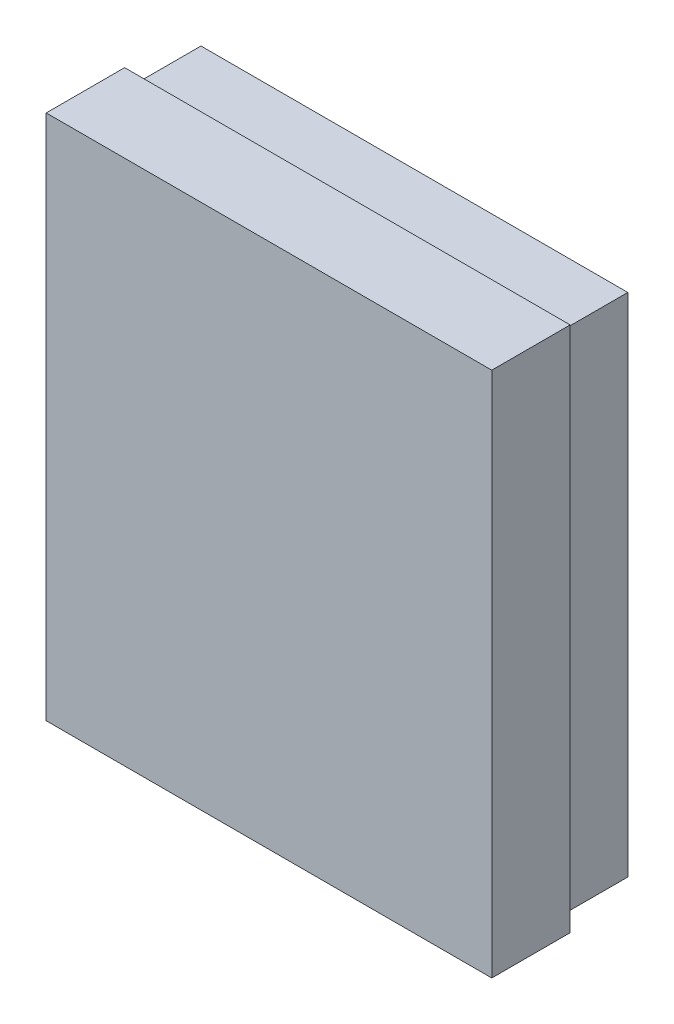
from build123d import *

# Parameters (mm, degrees)
SKETCH1_W          = 20.8788
SKETCH1_H          = 24.765
EXTRUDE1_DEPTH     = 3.2766
SKETCH2_W          = 21.794546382
SKETCH2_H          = 25.749541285
EXTRUDE2_DEPTH     = 3.8354
SKETCH3_W          = 4.597422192
SKETCH3_H          = 7.098960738
CUT_EXTRUDE1_DEPTH = 0.809017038


with BuildPart() as part:
    # Sketch1 → Extrude1 (new body)
    with BuildSketch(Plane.XY):
        with Locations((0.859498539, 2.571492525)):
            Rectangle(SKETCH1_W, SKETCH1_H)
    extrude(amount=EXTRUDE1_DEPTH)

    # Sketch2 → Extrude2 (add)
    with BuildSketch(Plane.XY.offset(3.2766)):
        with Locations((0.859498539, 2.571492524)):
            Rectangle(SKETCH2_W, SKETCH2_H)
    extrude(amount=EXTRUDE2_DEPTH)

    # Sketch3 → Cut-Extrude1 (cut)
    with BuildSketch(Plane.ZY.offset(10.037774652)):
        with Locations((4.265896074, 11.15785456)):
            Rectangle(SKETCH3_W, SKETCH3_H)
    extrude(amount=-CUT_EXTRUDE1_DEPTH, mode=Mode.SUBTRACT)


solid = part.part
